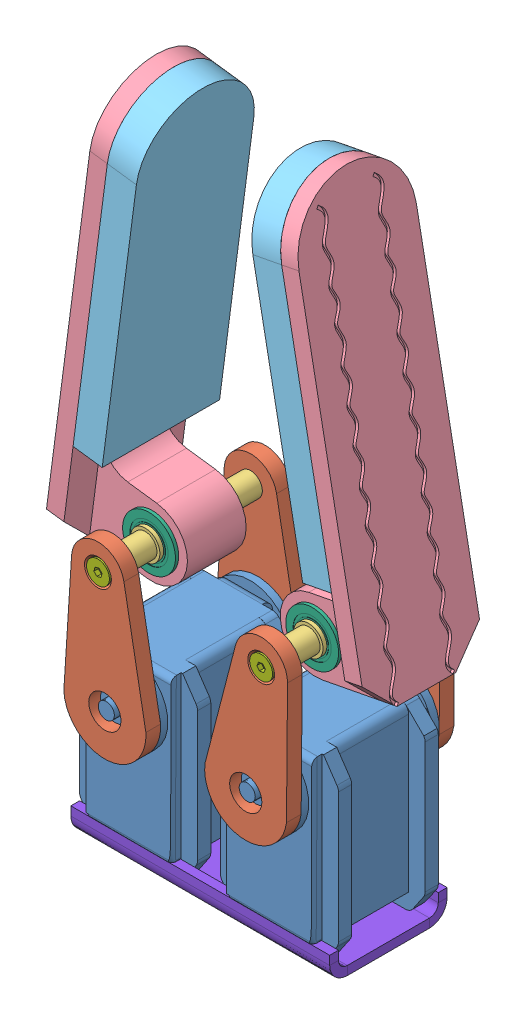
SolidWorks assembly Overall Assembly.SLDASM, configuration Default (file format 13000). Lengths in mm.
Overall size (131.57 225.29 119.4).
23 component instances, 8 part files, 52 mates.
Components (placement in the parent):
- Black box-1: Black box.SLDPRT [Default] at (35.5852 92.7632 53.7829) size (70.63 70.51 117)
- link_gripper-1: link_gripper.SLDPRT [Default] at (35.5852 92.7632 77.2829) x (0.991392 -0.130927 0) z (-0.130927 -0.991392 0) size (28 5 63)
- link_gripper-2: link_gripper.SLDPRT [Default] at (35.5852 92.7632 30.2829) x (-0.991392 0.130927 0) z (-0.130927 -0.991392 0) size (28 5 63)
- Black box-2: Black box.SLDPRT [Default] at (-12.4148 92.7632 53.7829) size (70.63 70.51 117)
- link_gripper-3: link_gripper.SLDPRT [Default] at (-12.4148 92.7632 77.2829) x (0.99828 0.058635 0) z (0.058635 -0.99828 0) size (28 5 63)
- link_gripper-4: link_gripper.SLDPRT [Default] at (-12.4148 92.7632 30.2829) x (-0.99828 -0.058635 0) z (0.058635 -0.99828 0) size (28 5 63)
- shaft_gripper-1: shaft_gripper.SLDPRT [Default] at (40.8223 132.4189 53.7829) x (-0.642703 0.766115 0) z (0 0 1) size (10 10 23.5)
- shaft_gripper-2: shaft_gripper.SLDPRT [Default] at (40.8223 132.4189 53.7829) x (0.221051 -0.975262 0) z (0 0 -1) size (10 10 23.5)
- finger_gripper-1: finger_gripper.SLDPRT [Default] at (68.6201 125.5427 33.7829) x (0.982021 0.18877 0) z (0.18877 -0.982021 0) size (38 40 144)
- shaft_gripper-3: shaft_gripper.SLDPRT [Default] at (-14.7602 132.6944 53.7829) x (0.372885 -0.927878 0) z (0 0 -1) size (10 10 23.5)
- shaft_gripper-4: shaft_gripper.SLDPRT [Default] at (-14.7602 132.6944 53.7829) x (-0.996273 0.086256 0) z (0 0 1) size (10 10 23.5)
- rubber pad-1: rubber pad.SLDPRT [Default] at (47.8151 201.9898 53.7829) x (0.18877 -0.982021 0) z (-0.982021 -0.18877 0) size (110 40 10)
- bearing_flanged-1: bearing_flanged.SLDPRT [7804K147] at (40.8223 132.4189 62.3829) x (-0.984892 -0.173169 0) z (0 0 -1) size (18 18 5)
- bearing_flanged-2: bearing_flanged.SLDPRT [7804K147] at (40.8223 132.4189 45.1829) x (-0.982329 0.187161 0) z (0 0 1) size (18 18 5)
- socket countersunk-1: socket countersunk.SLDPRT [B18.3.5M - 4 x 0.7 x 16 Socket FCHS  -- 16N] at (40.8223 132.4189 82.2829) x (0 0 -1) z (0.915939 -0.401318 0) size (16 7.8 7.8)
- socket countersunk-2: socket countersunk.SLDPRT [B18.3.5M - 4 x 0.7 x 16 Socket FCHS  -- 16N] at (40.8223 132.4189 25.2829) x (0 0 1) z (-0.987182 0.159597 0) size (16 7.8 7.8)
- finger_gripper-2: finger_gripper.SLDPRT [Default] at (-42.0962 124.1654 73.7829) x (-0.991566 0.129606 0) z (-0.129606 -0.991566 0) size (38 40 144)
- rubber pad-2: rubber pad.SLDPRT [Default] at (-25.9079 201.7214 53.7829) x (-0.129606 -0.991566 0) z (0.991566 -0.129606 0) size (110 40 10)
- socket countersunk-3: socket countersunk.SLDPRT [B18.3.5M - 4 x 0.7 x 16 Socket FCHS  -- 16N] at (-14.7602 132.6944 82.2829) x (0 0 -1) z (0.967983 -0.251017 0) size (16 7.8 7.8)
- socket countersunk-4: socket countersunk.SLDPRT [B18.3.5M - 4 x 0.7 x 16 Socket FCHS  -- 16N] at (-14.7602 132.6944 25.2829) x (0 0 1) z (-0.999999 0.001058 0) size (16 7.8 7.8)
- bearing_flanged-3: bearing_flanged.SLDPRT [7804K147] at (-14.7602 132.6944 62.3829) x (0.354897 -0.934905 0) z (0 0 -1) size (18 18 5)
- bearing_flanged-4: bearing_flanged.SLDPRT [7804K147] at (-14.7602 132.6944 45.1829) x (0.000487 -1 0) z (0 0 1) size (18 18 5)
- bracket-1: bracket.SLDPRT [Default] at (55.6852 44.6632 53.7829) x (0 1 0) z (-1 0 0) size (9 40 88.2)
Mates (geometry in assembly coordinates):
- Concentric1: concentric aligned: cylinder of Black box-1 through (35.5852 92.7632 81.7829) axis (0 0 -1) radius 5; cylinder of link_gripper-1 through (35.5852 92.7632 82.2829) axis (0 0 -1) radius 5.5
- Coincident1: coincident anti-aligned: plane of Black box-1 through (49.5852 92.7632 77.2829) normal (0 0 1); plane of link_gripper-1 through (35.5852 92.7632 77.2829) normal (0 0 -1)
- Concentric2: concentric anti-aligned: cylinder of Black box-1 through (35.5852 92.7632 34.2829) axis (0 0 -1) radius 4.75; cylinder of link_gripper-2 through (35.5852 92.7632 25.2829) axis (0 0 1) radius 5.5
- Coincident2: coincident anti-aligned: plane of Black box-1 through (40.3352 92.7632 30.2829) normal (0 0 -1); plane of link_gripper-2 through (35.5852 92.7632 30.2829) normal (0 0 1)
- Concentric3: concentric aligned: cylinder of Black box-2 through (-12.4148 92.7632 81.7829) axis (0 0 -1) radius 5; cylinder of link_gripper-3 through (-12.4148 92.7632 82.2829) axis (0 0 -1) radius 5.5
- Coincident3: coincident anti-aligned: plane of Black box-2 through (1.5852 92.7632 77.2829) normal (0 0 1); plane of link_gripper-3 through (-12.4148 92.7632 77.2829) normal (0 0 -1)
- Concentric4: concentric anti-aligned: cylinder of Black box-2 through (-12.4148 92.7632 34.2829) axis (0 0 -1) radius 4.75; cylinder of link_gripper-4 through (-12.4148 92.7632 25.2829) axis (0 0 1) radius 5.5
- Coincident4: coincident anti-aligned: plane of Black box-2 through (-7.6648 92.7632 30.2829) normal (0 0 -1); plane of link_gripper-4 through (-12.4148 92.7632 30.2829) normal (0 0 1)
- Concentric5: concentric aligned: cylinder of link_gripper-1 through (40.8223 132.4189 82.2829) axis (0 0 -1) radius 2.5; cylinder of shaft_gripper-1 through (40.8223 132.4189 77.2829) axis (0 0 -1) radius 4
- Concentric6: concentric aligned: cylinder of link_gripper-2 through (40.8223 132.4189 25.2829) axis (0 0 1) radius 2.5; cylinder of shaft_gripper-2 through (40.8223 132.4189 30.2829) axis (0 0 1) radius 1.6
- Coincident5: coincident anti-aligned: plane of link_gripper-2 through (35.5852 92.7632 30.2829) normal (0 0 1); plane of shaft_gripper-2 through (40.8223 132.4189 30.2829) normal (0 0 -1)
- Coincident6: coincident anti-aligned: plane of link_gripper-1 through (35.5852 92.7632 77.2829) normal (0 0 -1); plane of shaft_gripper-1 through (40.8223 132.4189 77.2829) normal (0 0 1)
- Concentric7: concentric anti-aligned: cylinder of shaft_gripper-1 through (40.8223 132.4189 77.2829) axis (0 0 -1) radius 1.6; cylinder of shaft_gripper-2 through (40.8223 132.4189 30.2829) axis (0 0 1) radius 1.6
- Concentric8: concentric anti-aligned: cylinder of shaft_gripper-3 through (-14.7602 132.6944 30.2829) axis (0 0 1) radius 1.6; cylinder of shaft_gripper-4 through (-14.7602 132.6944 77.2829) axis (0 0 -1) radius 1.6
- Concentric9: concentric aligned: cylinder of link_gripper-3 through (-14.7602 132.6944 82.2829) axis (0 0 -1) radius 2.5; cylinder of shaft_gripper-4 through (-14.7602 132.6944 77.2829) axis (0 0 -1) radius 4
- Concentric10: concentric aligned: cylinder of link_gripper-4 through (-14.7602 132.6944 25.2829) axis (0 0 1) radius 2.5; cylinder of shaft_gripper-3 through (-14.7602 132.6944 30.2829) axis (0 0 1) radius 1.6
- Coincident7: coincident anti-aligned: plane of link_gripper-4 through (-12.4148 92.7632 30.2829) normal (0 0 1); plane of shaft_gripper-3 through (-14.7602 132.6944 30.2829) normal (0 0 -1)
- Coincident8: coincident anti-aligned: plane of link_gripper-3 through (-12.4148 92.7632 77.2829) normal (0 0 -1); plane of shaft_gripper-4 through (-14.7602 132.6944 77.2829) normal (0 0 1)
- Coincident9: coincident anti-aligned: plane of finger_gripper-1 through (58.1975 147.9786 73.7829) normal (-0.982021 -0.18877 0); plane of rubber pad-1 through (39.3205 246.1807 53.7829) normal (0.982021 0.18877 0)
- Width1: width anti-aligned: plane of rubber pad-1 through (29.5003 244.293 73.7829) normal (0 0 1); plane of finger_gripper-1 through (29.5003 244.293 33.7829) normal (0 0 -1); plane of rubber pad-1 through (40.8223 132.4189 33.7829) normal (0 0 -1); plane of finger_gripper-1 through (40.8223 132.4189 73.7829) normal (0 0 1)
- Concentric12: concentric aligned: cylinder of finger_gripper-1 through (7.8958 240.1401 53.7829) axis (0.982021 0.18877 0) radius 20; cylinder of rubber pad-1 through (29.5003 244.293 53.7829) axis (0.982021 0.18877 0) radius 20
- Concentric13: concentric aligned: cylinder of finger_gripper-1 through (40.8223 132.4189 73.7829) axis (0 0 -1) radius 8; cylinder of bearing_flanged-1 through (40.8223 132.4189 59.8829) axis (0 0 -1) radius 4
- Coincident10: coincident anti-aligned: plane of finger_gripper-1 through (46.4896 155.9111 63.7829) normal (0 0 1); plane of bearing_flanged-1 through (39.6996 138.8045 63.7829) normal (0 0 -1)
- Concentric14: concentric anti-aligned: cylinder of finger_gripper-1 through (40.8223 132.4189 73.7829) axis (0 0 -1) radius 8; cylinder of bearing_flanged-2 through (40.8223 132.4189 47.6829) axis (0 0 1) radius 4
- Coincident11: coincident anti-aligned: plane of finger_gripper-1 through (40.8223 132.4189 43.7829) normal (0 0 -1); plane of bearing_flanged-2 through (39.6088 126.05 43.7829) normal (0 0 1)
- Concentric15: concentric anti-aligned: cylinder of shaft_gripper-2 through (40.8223 132.4189 41.3829) axis (0 0 1) radius 5; cylinder of finger_gripper-1 through (40.8223 132.4189 73.7829) axis (0 0 -1) radius 8
- Width2: width anti-aligned: plane of finger_gripper-1 through (46.4896 155.9111 63.7829) normal (0 0 1); plane of link_gripper-1 through (40.8223 132.4189 43.7829) normal (0 0 -1); plane of finger_gripper-1 through (35.5852 92.7632 77.2829) normal (0 0 -1); plane of link_gripper-2 through (35.5852 92.7632 30.2829) normal (0 0 1)
- Concentric17: concentric anti-aligned: cylinder of link_gripper-1 through (40.8223 132.4189 82.2829) axis (0 0 -1) radius 2.5; cylinder of socket countersunk-1 through (40.8223 132.4189 82.2829) axis (0 0 1) radius 2
- Coincident12: coincident aligned: plane of link_gripper-1 through (35.5852 92.7632 82.2829) normal (0 0 1); plane of socket countersunk-1 through (40.8223 132.4189 82.2829) normal (0 0 1)
- Concentric18: concentric anti-aligned: cylinder of link_gripper-2 through (40.8223 132.4189 25.2829) axis (0 0 1) radius 2.5; cylinder of socket countersunk-2 through (40.8223 132.4189 25.2829) axis (0 0 -1) radius 2
- Coincident13: coincident aligned: plane of link_gripper-2 through (35.5852 92.7632 25.2829) normal (0 0 -1); plane of socket countersunk-2 through (40.8223 132.4189 25.2829) normal (0 0 -1)
- Coincident14: coincident anti-aligned: plane of finger_gripper-2 through (-33.0362 147.1853 33.7829) normal (0.991566 -0.129606 0); plane of rubber pad-2 through (-20.0756 246.3419 53.7829) normal (-0.991566 0.129606 0)
- Width3: width anti-aligned: plane of rubber pad-2 through (-10.1599 245.0458 33.7829) normal (0 0 -1); plane of finger_gripper-2 through (-10.1599 245.0458 73.7829) normal (0 0 1); plane of rubber pad-2 through (-14.7602 132.6944 73.7829) normal (0 0 1); plane of finger_gripper-2 through (-14.7602 132.6944 33.7829) normal (0 0 -1)
- Concentric19: concentric aligned: cylinder of finger_gripper-2 through (11.6545 242.1945 53.7829) axis (-0.991566 0.129606 0) radius 20; cylinder of rubber pad-2 through (-10.1599 245.0458 53.7829) axis (-0.991566 0.129606 0) radius 20
- Concentric20: concentric aligned: cylinder of finger_gripper-2 through (-14.7602 132.6944 33.7829) axis (0 0 1) radius 8; cylinder of bearing_flanged-4 through (-14.7602 132.6944 47.6829) axis (0 0 1) radius 4
- Coincident15: coincident anti-aligned: plane of finger_gripper-2 through (-21.8245 155.8049 43.7829) normal (0 0 -1); plane of bearing_flanged-4 through (-8.2767 132.6976 43.7829) normal (0 0 1)
- Concentric21: concentric anti-aligned: cylinder of finger_gripper-2 through (-14.7602 132.6944 33.7829) axis (0 0 1) radius 8; cylinder of bearing_flanged-3 through (-14.7602 132.6944 59.8829) axis (0 0 -1) radius 4
- Coincident16: coincident anti-aligned: plane of finger_gripper-2 through (-14.7602 132.6944 63.7829) normal (0 0 1); plane of bearing_flanged-3 through (-20.8216 130.3934 63.7829) normal (0 0 -1)
- Concentric22: concentric anti-aligned: cylinder of shaft_gripper-4 through (-14.7602 132.6944 66.1829) axis (0 0 -1) radius 5; cylinder of finger_gripper-2 through (-14.7602 132.6944 33.7829) axis (0 0 1) radius 8
- Width4: width anti-aligned: plane of finger_gripper-2 through (-21.8245 155.8049 43.7829) normal (0 0 -1); plane of link_gripper-3 through (-14.7602 132.6944 63.7829) normal (0 0 1); plane of finger_gripper-2 through (-12.4148 92.7632 77.2829) normal (0 0 -1); plane of link_gripper-4 through (-12.4148 92.7632 30.2829) normal (0 0 1)
- Concentric23: concentric anti-aligned: cylinder of link_gripper-3 through (-14.7602 132.6944 82.2829) axis (0 0 -1) radius 2.5; cylinder of socket countersunk-3 through (-14.7602 132.6944 82.2829) axis (0 0 1) radius 2
- Coincident17: coincident aligned: plane of link_gripper-3 through (-12.4148 92.7632 82.2829) normal (0 0 1); plane of socket countersunk-3 through (-14.7602 132.6944 82.2829) normal (0 0 1)
- Concentric24: concentric anti-aligned: cylinder of link_gripper-4 through (-14.7602 132.6944 25.2829) axis (0 0 1) radius 2.5; cylinder of socket countersunk-4 through (-14.7602 132.6944 25.2829) axis (0 0 -1) radius 2
- Coincident18: coincident aligned: plane of link_gripper-4 through (-12.4148 92.7632 25.2829) normal (0 0 -1); plane of socket countersunk-4 through (-14.7602 132.6944 25.2829) normal (0 0 -1)
- Coincident22: coincident anti-aligned: plane of Black box-1 through (35.5852 92.7632 70.7829) normal (0 0 1); plane of bracket-1 through (-32.5148 44.6632 70.7829) normal (0 0 -1)
- Coincident23: coincident anti-aligned: plane of Black box-2 through (-12.4148 92.7632 70.7829) normal (0 0 1); plane of bracket-1 through (-32.5148 44.6632 70.7829) normal (0 0 -1)
- Coincident26: coincident aligned: plane of Black box-2 through (-32.5148 98.2632 68.2829) normal (-1 0 0); plane of bracket-1 through (-32.5148 41.6632 67.7829) normal (-1 0 0)
- Coincident27: coincident aligned: plane of Black box-2 through (-32.5148 98.2632 39.2829) normal (-1 0 0); plane of bracket-1 through (-32.5148 47.6632 67.7829) normal (-1 0 0)
- Coincident28: coincident aligned: plane of Black box-1 through (55.6852 52.1632 68.2829) normal (1 0 0); plane of bracket-1 through (55.6852 47.6632 67.7829) normal (1 0 0)
- Coincident29: coincident aligned: plane of Black box-1 through (55.6852 52.1632 39.2829) normal (1 0 0); plane of bracket-1 through (55.6852 41.6632 39.7829) normal (1 0 0)
- Coincident30: coincident anti-aligned: plane of Black box-1 through (20.5852 44.6632 68.2829) normal (0 -1 0); plane of bracket-1 through (-32.5148 44.6632 53.7829) normal (0 1 0)
- Coincident31: coincident anti-aligned: plane of Black box-2 through (-27.4148 44.6632 68.2829) normal (0 -1 0); plane of bracket-1 through (-32.5148 44.6632 53.7829) normal (0 1 0)
